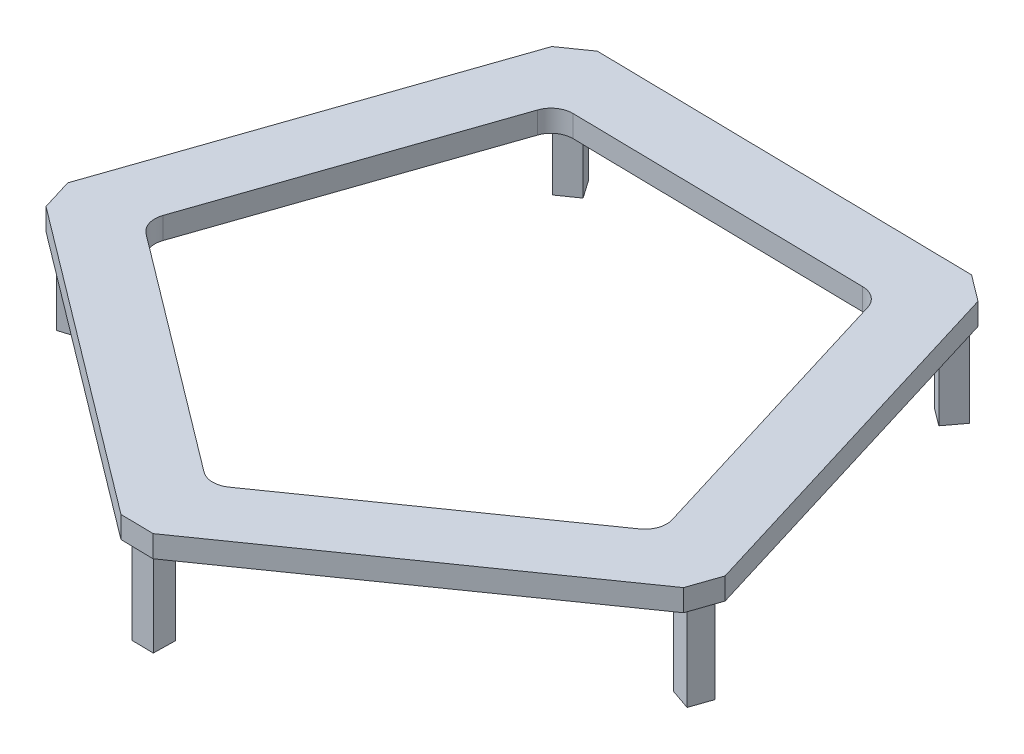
from build123d import *

# Parameters (mm, degrees)
BOSS_EXTRUDE1_DEPTH = 6.35
BOSS_EXTRUDE2_DEPTH = 25.4
BOSS_EXTRUDE3_DEPTH = 6.35
FILLET1_R           = 6.35


with BuildPart() as part:
    # Sketch2 → Boss-Extrude1 (new body)
    with BuildSketch(Plane(origin=(0, 0, 0), x_dir=(1, 0, 0), z_dir=(0, 1, 0))):
        Polygon((2.999692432, -101.032739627), (-6.523856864, -100.866505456), (-95.160889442, -34.073710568), (-97.94572993, -24.964907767), (-61.812356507, 79.974028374), (-54.009933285, 85.43734393), (56.958752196, 83.50037832), (64.565755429, 77.768090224), (97.014801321, -28.367956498), (93.91376465, -37.374020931), align=None)
        Polygon((3.165926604, -91.509190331), (-6.357622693, -91.342956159), (-86.052086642, -31.28887008), (-88.836927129, -22.18006728), (-56.349040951, 72.171605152), (-48.546617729, 77.634920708), (51.2264641, 75.893375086), (58.833467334, 70.161086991), (88.008736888, -25.266919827), (84.907700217, -34.27298426), align=None, mode=Mode.SUBTRACT)
    extrude(amount=BOSS_EXTRUDE1_DEPTH)

    # Sketch3 → Boss-Extrude2 (add)
    with BuildSketch(Plane.XZ):
        Polygon((-4.908892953, 99.306952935), (1.440139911, 99.417775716), (1.550962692, 93.068742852), (-4.798070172, 92.957920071), align=None)
        Polygon((-95.963456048, 26.018901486), (-94.106895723, 32.091436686), (-88.034360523, 30.234876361), (-89.890920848, 24.162341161), align=None)
        Polygon((-54.399784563, -83.226387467), (-50.757574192, -78.024771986), (-55.959189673, -74.382561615), (-59.601400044, -79.584177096), align=None)
        Polygon((57.271204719, -81.277163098), (53.449679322, -76.205827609), (58.521014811, -72.384302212), (62.342540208, -77.455637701), align=None)
        Polygon((88.992908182, 27.284770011), (94.996951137, 29.352127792), (92.929593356, 35.356170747), (86.925550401, 33.288812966), align=None)
    extrude(amount=BOSS_EXTRUDE2_DEPTH)

    # Sketch4 → Boss-Extrude3 (add)
    with BuildSketch(Plane(origin=(0, 6.35, 0), x_dir=(1, 0, 0), z_dir=(0, 1, 0))):
        Polygon((-88.836927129, -22.18006728), (-86.052086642, -31.28887008), (-6.357622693, -91.342956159), (3.165926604, -91.509190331), (84.907700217, -34.27298426), (88.008736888, -25.266919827), (58.833467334, 70.161086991), (51.2264641, 75.893375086), (-48.546617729, 77.634920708), (-56.349040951, 72.171605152), align=None)
        Polygon((-1.411516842, -80.865745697), (76.471711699, -26.331321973), (48.673633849, 64.592093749), (-46.389751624, 66.251431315), (-77.344077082, -23.646457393), align=None, mode=Mode.SUBTRACT)
    extrude(amount=-BOSS_EXTRUDE3_DEPTH)

    # Fillet1
    fillet1_edges = [part.edges().sort_by_distance(p)[0] for p in [
        (-77.344077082, 3.175, 23.646457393),
        (-46.389751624, 3.175, -66.251431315),
        (48.673633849, 3.175, -64.592093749),
        (76.471711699, 3.175, 26.331321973),
        (-1.411516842, 3.175, 80.865745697),
    ]]
    fillet(fillet1_edges, radius=FILLET1_R)


solid = part.part
